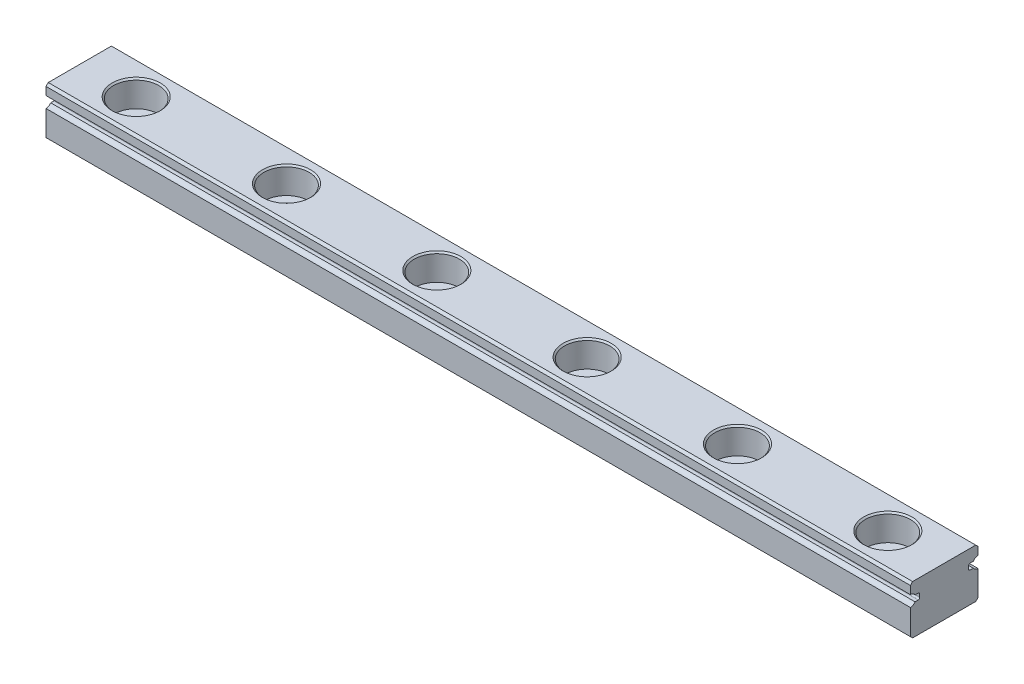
ISO-10303-21;
HEADER;
FILE_DESCRIPTION(('STEP AP214'),'2;1');
FILE_NAME('part.step','',(''),(''),'','','');
FILE_SCHEMA(('AUTOMOTIVE_DESIGN { 1 0 10303 214 1 1 1 1 }'));
ENDSEC;
DATA;
#1=APPLICATION_CONTEXT('core data for automotive mechanical design processes');
#2=APPLICATION_PROTOCOL_DEFINITION('international standard','automotive_design',2000,#1);
#3=PRODUCT_CONTEXT('',#1,'mechanical');
#4=PRODUCT('Part','Part','',(#3));
#5=PRODUCT_RELATED_PRODUCT_CATEGORY('part','',(#4));
#6=PRODUCT_DEFINITION_FORMATION('','',#4);
#7=PRODUCT_DEFINITION_CONTEXT('part definition',#1,'design');
#8=PRODUCT_DEFINITION('design','',#6,#7);
#9=PRODUCT_DEFINITION_SHAPE('','',#8);
#10=(LENGTH_UNIT() NAMED_UNIT(*) SI_UNIT(.MILLI.,.METRE.));
#11=(NAMED_UNIT(*) PLANE_ANGLE_UNIT() SI_UNIT($,.RADIAN.));
#12=(NAMED_UNIT(*) SI_UNIT($,.STERADIAN.) SOLID_ANGLE_UNIT());
#13=UNCERTAINTY_MEASURE_WITH_UNIT(LENGTH_MEASURE(1.E-05),#10,'distance_accuracy_value','');
#14=(GEOMETRIC_REPRESENTATION_CONTEXT(3) GLOBAL_UNCERTAINTY_ASSIGNED_CONTEXT((#13)) GLOBAL_UNIT_ASSIGNED_CONTEXT((#10,
#11,#12)) REPRESENTATION_CONTEXT('',''));
#15=CARTESIAN_POINT('',(0.,0.,0.));
#16=DIRECTION('',(0.,0.,1.));
#17=DIRECTION('',(1.,0.,0.));
#18=AXIS2_PLACEMENT_3D('',#15,#16,#17);
#19=CARTESIAN_POINT('',(115.,6.5,-4.2));
#20=DIRECTION('',(0.,-1.,0.));
#21=DIRECTION('',(0.,0.,-1.));
#22=AXIS2_PLACEMENT_3D('',#19,#20,#21);
#23=PLANE('',#22);
#24=DIRECTION('',(0.,0.,1.));
#25=VECTOR('',#24,1.);
#26=CARTESIAN_POINT('',(0.,6.5,-4.2));
#27=LINE('',#26,#25);
#28=CARTESIAN_POINT('',(0.,6.5,-4.2));
#29=VERTEX_POINT('',#28);
#30=CARTESIAN_POINT('',(0.,6.5,4.2));
#31=VERTEX_POINT('',#30);
#32=EDGE_CURVE('E11',#29,#31,#27,.T.);
#33=ORIENTED_EDGE('',*,*,#32,.T.);
#34=DIRECTION('',(-1.,0.,0.));
#35=VECTOR('',#34,1.);
#36=CARTESIAN_POINT('',(115.,6.5,4.2));
#37=LINE('',#36,#35);
#38=CARTESIAN_POINT('',(115.,6.5,4.2));
#39=VERTEX_POINT('',#38);
#40=EDGE_CURVE('E42',#39,#31,#37,.T.);
#41=ORIENTED_EDGE('',*,*,#40,.F.);
#42=DIRECTION('',(0.,0.,1.));
#43=VECTOR('',#42,1.);
#44=CARTESIAN_POINT('',(115.,6.5,-4.2));
#45=LINE('',#44,#43);
#46=CARTESIAN_POINT('',(115.,6.5,-4.2));
#47=VERTEX_POINT('',#46);
#48=EDGE_CURVE('E591',#47,#39,#45,.T.);
#49=ORIENTED_EDGE('',*,*,#48,.F.);
#50=DIRECTION('',(-1.,0.,0.));
#51=VECTOR('',#50,1.);
#52=CARTESIAN_POINT('',(115.,6.5,-4.2));
#53=LINE('',#52,#51);
#54=EDGE_CURVE('E28',#47,#29,#53,.T.);
#55=ORIENTED_EDGE('',*,*,#54,.T.);
#56=EDGE_LOOP('',(#33,#41,#49,#55));
#57=FACE_BOUND('',#56,.T.);
#58=CARTESIAN_POINT('',(7.5,6.5,0.));
#59=DIRECTION('',(0.,-1.,0.));
#60=DIRECTION('',(0.,0.,-1.));
#61=AXIS2_PLACEMENT_3D('',#58,#59,#60);
#62=CIRCLE('',#61,3.205);
#63=CARTESIAN_POINT('',(7.5,6.5,-3.205));
#64=VERTEX_POINT('',#63);
#65=EDGE_CURVE('E631',#64,#64,#62,.T.);
#66=ORIENTED_EDGE('',*,*,#65,.T.);
#67=EDGE_LOOP('',(#66));
#68=FACE_BOUND('',#67,.T.);
#69=CARTESIAN_POINT('',(47.5,6.5,0.));
#70=DIRECTION('',(0.,-1.,0.));
#71=DIRECTION('',(0.,0.,-1.));
#72=AXIS2_PLACEMENT_3D('',#69,#70,#71);
#73=CIRCLE('',#72,3.205);
#74=CARTESIAN_POINT('',(47.5,6.5,-3.205));
#75=VERTEX_POINT('',#74);
#76=EDGE_CURVE('E635',#75,#75,#73,.T.);
#77=ORIENTED_EDGE('',*,*,#76,.T.);
#78=EDGE_LOOP('',(#77));
#79=FACE_BOUND('',#78,.T.);
#80=CARTESIAN_POINT('',(67.5,6.5,0.));
#81=DIRECTION('',(0.,-1.,0.));
#82=DIRECTION('',(0.,0.,-1.));
#83=AXIS2_PLACEMENT_3D('',#80,#81,#82);
#84=CIRCLE('',#83,3.205);
#85=CARTESIAN_POINT('',(67.5,6.5,-3.205));
#86=VERTEX_POINT('',#85);
#87=EDGE_CURVE('E660',#86,#86,#84,.T.);
#88=ORIENTED_EDGE('',*,*,#87,.T.);
#89=EDGE_LOOP('',(#88));
#90=FACE_BOUND('',#89,.T.);
#91=CARTESIAN_POINT('',(87.5,6.5,0.));
#92=DIRECTION('',(0.,-1.,0.));
#93=DIRECTION('',(0.,0.,-1.));
#94=AXIS2_PLACEMENT_3D('',#91,#92,#93);
#95=CIRCLE('',#94,3.205);
#96=CARTESIAN_POINT('',(87.5,6.5,-3.205));
#97=VERTEX_POINT('',#96);
#98=EDGE_CURVE('E664',#97,#97,#95,.T.);
#99=ORIENTED_EDGE('',*,*,#98,.T.);
#100=EDGE_LOOP('',(#99));
#101=FACE_BOUND('',#100,.T.);
#102=CARTESIAN_POINT('',(107.5,6.5,0.));
#103=DIRECTION('',(0.,-1.,0.));
#104=DIRECTION('',(0.,0.,-1.));
#105=AXIS2_PLACEMENT_3D('',#102,#103,#104);
#106=CIRCLE('',#105,3.205);
#107=CARTESIAN_POINT('',(107.5,6.5,-3.205));
#108=VERTEX_POINT('',#107);
#109=EDGE_CURVE('E539',#108,#108,#106,.T.);
#110=ORIENTED_EDGE('',*,*,#109,.T.);
#111=EDGE_LOOP('',(#110));
#112=FACE_BOUND('',#111,.T.);
#113=CARTESIAN_POINT('',(27.5,6.5,0.));
#114=DIRECTION('',(0.,-1.,0.));
#115=DIRECTION('',(0.,0.,-1.));
#116=AXIS2_PLACEMENT_3D('',#113,#114,#115);
#117=CIRCLE('',#116,3.205);
#118=CARTESIAN_POINT('',(27.5,6.5,-3.205));
#119=VERTEX_POINT('',#118);
#120=EDGE_CURVE('E535',#119,#119,#117,.T.);
#121=ORIENTED_EDGE('',*,*,#120,.T.);
#122=EDGE_LOOP('',(#121));
#123=FACE_BOUND('',#122,.T.);
#124=ADVANCED_FACE('F17',(#57,#68,#79,#90,#101,#112,#123),#23,.F.);
#125=CARTESIAN_POINT('',(115.,4.4,4.5));
#126=DIRECTION('',(1.,0.,0.));
#127=DIRECTION('',(0.,1.,0.));
#128=AXIS2_PLACEMENT_3D('',#125,#126,#127);
#129=PLANE('',#128);
#130=DIRECTION('',(0.,-0.707106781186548,0.707106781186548));
#131=VECTOR('',#130,1.);
#132=CARTESIAN_POINT('',(115.,6.5,4.2));
#133=LINE('',#132,#131);
#134=CARTESIAN_POINT('',(115.,6.2,4.5));
#135=VERTEX_POINT('',#134);
#136=EDGE_CURVE('E374',#39,#135,#133,.T.);
#137=ORIENTED_EDGE('',*,*,#136,.T.);
#138=DIRECTION('',(0.,-1.,0.));
#139=VECTOR('',#138,1.);
#140=CARTESIAN_POINT('',(115.,6.2,4.5));
#141=LINE('',#140,#139);
#142=CARTESIAN_POINT('',(115.,5.14204110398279,4.5));
#143=VERTEX_POINT('',#142);
#144=EDGE_CURVE('E371',#135,#143,#141,.T.);
#145=ORIENTED_EDGE('',*,*,#144,.T.);
#146=CARTESIAN_POINT('',(115.,4.4,4.5));
#147=DIRECTION('',(1.,0.,0.));
#148=DIRECTION('',(0.,0.,-1.));
#149=AXIS2_PLACEMENT_3D('',#146,#147,#148);
#150=CIRCLE('',#149,0.742041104);
#151=CARTESIAN_POINT('',(115.,4.8,3.875));
#152=VERTEX_POINT('',#151);
#153=EDGE_CURVE('E356',#152,#143,#150,.T.);
#154=ORIENTED_EDGE('',*,*,#153,.F.);
#155=DIRECTION('',(0.,0.,-1.));
#156=VECTOR('',#155,1.);
#157=CARTESIAN_POINT('',(115.,4.8,3.875));
#158=LINE('',#157,#156);
#159=CARTESIAN_POINT('',(115.,4.8,3.45));
#160=VERTEX_POINT('',#159);
#161=EDGE_CURVE('E378',#152,#160,#158,.T.);
#162=ORIENTED_EDGE('',*,*,#161,.T.);
#163=CARTESIAN_POINT('',(115.,4.6,3.45));
#164=DIRECTION('',(1.,0.,0.));
#165=DIRECTION('',(0.,0.,-1.));
#166=AXIS2_PLACEMENT_3D('',#163,#164,#165);
#167=CIRCLE('',#166,0.2);
#168=CARTESIAN_POINT('',(115.,4.6,3.25));
#169=VERTEX_POINT('',#168);
#170=EDGE_CURVE('E601',#169,#160,#167,.T.);
#171=ORIENTED_EDGE('',*,*,#170,.F.);
#172=DIRECTION('',(0.,-1.,0.));
#173=VECTOR('',#172,1.);
#174=CARTESIAN_POINT('',(115.,4.6,3.25));
#175=LINE('',#174,#173);
#176=CARTESIAN_POINT('',(115.,4.2,3.25));
#177=VERTEX_POINT('',#176);
#178=EDGE_CURVE('E418',#169,#177,#175,.T.);
#179=ORIENTED_EDGE('',*,*,#178,.T.);
#180=CARTESIAN_POINT('',(115.,4.2,3.45));
#181=DIRECTION('',(1.,0.,0.));
#182=DIRECTION('',(0.,0.,-1.));
#183=AXIS2_PLACEMENT_3D('',#180,#181,#182);
#184=CIRCLE('',#183,0.2);
#185=CARTESIAN_POINT('',(115.,4.,3.45));
#186=VERTEX_POINT('',#185);
#187=EDGE_CURVE('E625',#186,#177,#184,.T.);
#188=ORIENTED_EDGE('',*,*,#187,.F.);
#189=DIRECTION('',(0.,0.,1.));
#190=VECTOR('',#189,1.);
#191=CARTESIAN_POINT('',(115.,4.,3.45));
#192=LINE('',#191,#190);
#193=CARTESIAN_POINT('',(115.,4.,3.875));
#194=VERTEX_POINT('',#193);
#195=EDGE_CURVE('E511',#186,#194,#192,.T.);
#196=ORIENTED_EDGE('',*,*,#195,.T.);
#197=CARTESIAN_POINT('',(115.,4.4,4.5));
#198=DIRECTION('',(1.,0.,0.));
#199=DIRECTION('',(0.,0.,-1.));
#200=AXIS2_PLACEMENT_3D('',#197,#198,#199);
#201=CIRCLE('',#200,0.742041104);
#202=CARTESIAN_POINT('',(115.,3.65795889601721,4.5));
#203=VERTEX_POINT('',#202);
#204=EDGE_CURVE('E497',#203,#194,#201,.T.);
#205=ORIENTED_EDGE('',*,*,#204,.F.);
#206=DIRECTION('',(0.,-1.,0.));
#207=VECTOR('',#206,1.);
#208=CARTESIAN_POINT('',(115.,3.65795889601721,4.5));
#209=LINE('',#208,#207);
#210=CARTESIAN_POINT('',(115.,0.3,4.5));
#211=VERTEX_POINT('',#210);
#212=EDGE_CURVE('E507',#203,#211,#209,.T.);
#213=ORIENTED_EDGE('',*,*,#212,.T.);
#214=DIRECTION('',(0.,-0.707106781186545,-0.70710678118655));
#215=VECTOR('',#214,1.);
#216=CARTESIAN_POINT('',(115.,0.3,4.5));
#217=LINE('',#216,#215);
#218=CARTESIAN_POINT('',(115.,0.,4.2));
#219=VERTEX_POINT('',#218);
#220=EDGE_CURVE('E467',#211,#219,#217,.T.);
#221=ORIENTED_EDGE('',*,*,#220,.T.);
#222=DIRECTION('',(0.,0.,-1.));
#223=VECTOR('',#222,1.);
#224=CARTESIAN_POINT('',(115.,0.,4.2));
#225=LINE('',#224,#223);
#226=CARTESIAN_POINT('',(115.,0.,-4.2));
#227=VERTEX_POINT('',#226);
#228=EDGE_CURVE('E463',#219,#227,#225,.T.);
#229=ORIENTED_EDGE('',*,*,#228,.T.);
#230=DIRECTION('',(0.,0.707106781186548,-0.707106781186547));
#231=VECTOR('',#230,1.);
#232=CARTESIAN_POINT('',(115.,0.,-4.2));
#233=LINE('',#232,#231);
#234=CARTESIAN_POINT('',(115.,0.3,-4.5));
#235=VERTEX_POINT('',#234);
#236=EDGE_CURVE('E468',#227,#235,#233,.T.);
#237=ORIENTED_EDGE('',*,*,#236,.T.);
#238=DIRECTION('',(0.,1.,0.));
#239=VECTOR('',#238,1.);
#240=CARTESIAN_POINT('',(115.,0.3,-4.5));
#241=LINE('',#240,#239);
#242=CARTESIAN_POINT('',(115.,3.65795889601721,-4.5));
#243=VERTEX_POINT('',#242);
#244=EDGE_CURVE('E489',#235,#243,#241,.T.);
#245=ORIENTED_EDGE('',*,*,#244,.T.);
#246=CARTESIAN_POINT('',(115.,4.4,-4.5));
#247=DIRECTION('',(1.,0.,0.));
#248=DIRECTION('',(0.,0.,-1.));
#249=AXIS2_PLACEMENT_3D('',#246,#247,#248);
#250=CIRCLE('',#249,0.742041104);
#251=CARTESIAN_POINT('',(115.,4.,-3.875));
#252=VERTEX_POINT('',#251);
#253=EDGE_CURVE('E424',#252,#243,#250,.T.);
#254=ORIENTED_EDGE('',*,*,#253,.F.);
#255=DIRECTION('',(0.,0.,1.));
#256=VECTOR('',#255,1.);
#257=CARTESIAN_POINT('',(115.,4.,-3.875));
#258=LINE('',#257,#256);
#259=CARTESIAN_POINT('',(115.,4.,-3.45));
#260=VERTEX_POINT('',#259);
#261=EDGE_CURVE('E399',#252,#260,#258,.T.);
#262=ORIENTED_EDGE('',*,*,#261,.T.);
#263=CARTESIAN_POINT('',(115.,4.2,-3.45));
#264=DIRECTION('',(1.,0.,0.));
#265=DIRECTION('',(0.,0.,-1.));
#266=AXIS2_PLACEMENT_3D('',#263,#264,#265);
#267=CIRCLE('',#266,0.2);
#268=CARTESIAN_POINT('',(115.,4.2,-3.25));
#269=VERTEX_POINT('',#268);
#270=EDGE_CURVE('E452',#269,#260,#267,.T.);
#271=ORIENTED_EDGE('',*,*,#270,.F.);
#272=DIRECTION('',(0.,1.,0.));
#273=VECTOR('',#272,1.);
#274=CARTESIAN_POINT('',(115.,4.2,-3.25));
#275=LINE('',#274,#273);
#276=CARTESIAN_POINT('',(115.,4.6,-3.25));
#277=VERTEX_POINT('',#276);
#278=EDGE_CURVE('E396',#269,#277,#275,.T.);
#279=ORIENTED_EDGE('',*,*,#278,.T.);
#280=CARTESIAN_POINT('',(115.,4.6,-3.45));
#281=DIRECTION('',(1.,0.,0.));
#282=DIRECTION('',(0.,0.,-1.));
#283=AXIS2_PLACEMENT_3D('',#280,#281,#282);
#284=CIRCLE('',#283,0.2);
#285=CARTESIAN_POINT('',(115.,4.8,-3.45));
#286=VERTEX_POINT('',#285);
#287=EDGE_CURVE('E409',#286,#277,#284,.T.);
#288=ORIENTED_EDGE('',*,*,#287,.F.);
#289=DIRECTION('',(0.,0.,-1.));
#290=VECTOR('',#289,1.);
#291=CARTESIAN_POINT('',(115.,4.8,-3.45));
#292=LINE('',#291,#290);
#293=CARTESIAN_POINT('',(115.,4.8,-3.875));
#294=VERTEX_POINT('',#293);
#295=EDGE_CURVE('E400',#286,#294,#292,.T.);
#296=ORIENTED_EDGE('',*,*,#295,.T.);
#297=CARTESIAN_POINT('',(115.,4.4,-4.5));
#298=DIRECTION('',(1.,0.,0.));
#299=DIRECTION('',(0.,0.,-1.));
#300=AXIS2_PLACEMENT_3D('',#297,#298,#299);
#301=CIRCLE('',#300,0.742041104);
#302=CARTESIAN_POINT('',(115.,5.14204110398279,-4.5));
#303=VERTEX_POINT('',#302);
#304=EDGE_CURVE('E446',#303,#294,#301,.T.);
#305=ORIENTED_EDGE('',*,*,#304,.F.);
#306=DIRECTION('',(0.,1.,0.));
#307=VECTOR('',#306,1.);
#308=CARTESIAN_POINT('',(115.,5.14204110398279,-4.5));
#309=LINE('',#308,#307);
#310=CARTESIAN_POINT('',(115.,6.2,-4.5));
#311=VERTEX_POINT('',#310);
#312=EDGE_CURVE('E401',#303,#311,#309,.T.);
#313=ORIENTED_EDGE('',*,*,#312,.T.);
#314=DIRECTION('',(0.,0.707106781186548,0.707106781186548));
#315=VECTOR('',#314,1.);
#316=CARTESIAN_POINT('',(115.,6.2,-4.5));
#317=LINE('',#316,#315);
#318=EDGE_CURVE('E405',#311,#47,#317,.T.);
#319=ORIENTED_EDGE('',*,*,#318,.T.);
#320=ORIENTED_EDGE('',*,*,#48,.T.);
#321=EDGE_LOOP('',(#137,#145,#154,#162,#171,#179,#188,#196,#205,#213,#221,#229,#237,#245,#254,
#262,#271,#279,#288,#296,#305,#313,#319,#320));
#322=FACE_BOUND('',#321,.T.);
#323=ADVANCED_FACE('F372',(#322),#129,.T.);
#324=CARTESIAN_POINT('',(115.,6.2,-4.5));
#325=DIRECTION('',(0.,-0.707106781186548,0.707106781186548));
#326=DIRECTION('',(-1.,0.,0.));
#327=AXIS2_PLACEMENT_3D('',#324,#325,#326);
#328=PLANE('',#327);
#329=DIRECTION('',(0.,0.707106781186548,0.707106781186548));
#330=VECTOR('',#329,1.);
#331=CARTESIAN_POINT('',(0.,6.2,-4.5));
#332=LINE('',#331,#330);
#333=CARTESIAN_POINT('',(0.,6.2,-4.5));
#334=VERTEX_POINT('',#333);
#335=EDGE_CURVE('E587',#334,#29,#332,.T.);
#336=ORIENTED_EDGE('',*,*,#335,.T.);
#337=ORIENTED_EDGE('',*,*,#54,.F.);
#338=ORIENTED_EDGE('',*,*,#318,.F.);
#339=DIRECTION('',(-1.,0.,0.));
#340=VECTOR('',#339,1.);
#341=CARTESIAN_POINT('',(115.,6.2,-4.5));
#342=LINE('',#341,#340);
#343=EDGE_CURVE('E592',#311,#334,#342,.T.);
#344=ORIENTED_EDGE('',*,*,#343,.T.);
#345=EDGE_LOOP('',(#336,#337,#338,#344));
#346=FACE_BOUND('',#345,.T.);
#347=ADVANCED_FACE('F869',(#346),#328,.F.);
#348=CARTESIAN_POINT('',(115.,6.5,4.2));
#349=DIRECTION('',(0.,-0.707106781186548,-0.707106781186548));
#350=DIRECTION('',(0.,-0.707106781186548,0.707106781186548));
#351=AXIS2_PLACEMENT_3D('',#348,#349,#350);
#352=PLANE('',#351);
#353=DIRECTION('',(0.,-0.707106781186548,0.707106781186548));
#354=VECTOR('',#353,1.);
#355=CARTESIAN_POINT('',(0.,6.5,4.2));
#356=LINE('',#355,#354);
#357=CARTESIAN_POINT('',(0.,6.2,4.5));
#358=VERTEX_POINT('',#357);
#359=EDGE_CURVE('E614',#31,#358,#356,.T.);
#360=ORIENTED_EDGE('',*,*,#359,.T.);
#361=DIRECTION('',(-1.,0.,0.));
#362=VECTOR('',#361,1.);
#363=CARTESIAN_POINT('',(115.,6.2,4.5));
#364=LINE('',#363,#362);
#365=EDGE_CURVE('E368',#135,#358,#364,.T.);
#366=ORIENTED_EDGE('',*,*,#365,.F.);
#367=ORIENTED_EDGE('',*,*,#136,.F.);
#368=ORIENTED_EDGE('',*,*,#40,.T.);
#369=EDGE_LOOP('',(#360,#366,#367,#368));
#370=FACE_BOUND('',#369,.T.);
#371=ADVANCED_FACE('F1011',(#370),#352,.F.);
#372=CARTESIAN_POINT('',(115.,6.2,4.5));
#373=DIRECTION('',(0.,0.,-1.));
#374=DIRECTION('',(0.,-1.,0.));
#375=AXIS2_PLACEMENT_3D('',#372,#373,#374);
#376=PLANE('',#375);
#377=DIRECTION('',(0.,-1.,0.));
#378=VECTOR('',#377,1.);
#379=CARTESIAN_POINT('',(0.,6.2,4.5));
#380=LINE('',#379,#378);
#381=CARTESIAN_POINT('',(0.,5.14204110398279,4.5));
#382=VERTEX_POINT('',#381);
#383=EDGE_CURVE('E382',#358,#382,#380,.T.);
#384=ORIENTED_EDGE('',*,*,#383,.T.);
#385=DIRECTION('',(-1.,0.,0.));
#386=VECTOR('',#385,1.);
#387=CARTESIAN_POINT('',(115.,5.14204110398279,4.5));
#388=LINE('',#387,#386);
#389=EDGE_CURVE('E360',#143,#382,#388,.T.);
#390=ORIENTED_EDGE('',*,*,#389,.F.);
#391=ORIENTED_EDGE('',*,*,#144,.F.);
#392=ORIENTED_EDGE('',*,*,#365,.T.);
#393=EDGE_LOOP('',(#384,#390,#391,#392));
#394=FACE_BOUND('',#393,.T.);
#395=ADVANCED_FACE('F380',(#394),#376,.F.);
#396=CARTESIAN_POINT('',(115.,4.4,4.5));
#397=DIRECTION('',(1.,0.,0.));
#398=DIRECTION('',(0.,0.,1.));
#399=AXIS2_PLACEMENT_3D('',#396,#397,#398);
#400=CYLINDRICAL_SURFACE('',#399,0.742041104);
#401=CARTESIAN_POINT('',(0.,4.4,4.5));
#402=DIRECTION('',(1.,0.,0.));
#403=DIRECTION('',(0.,0.,-1.));
#404=AXIS2_PLACEMENT_3D('',#401,#402,#403);
#405=CIRCLE('',#404,0.742041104);
#406=CARTESIAN_POINT('',(0.,4.8,3.875));
#407=VERTEX_POINT('',#406);
#408=EDGE_CURVE('E462',#407,#382,#405,.T.);
#409=ORIENTED_EDGE('',*,*,#408,.F.);
#410=DIRECTION('',(-1.,0.,0.));
#411=VECTOR('',#410,1.);
#412=CARTESIAN_POINT('',(115.,4.8,3.875));
#413=LINE('',#412,#411);
#414=EDGE_CURVE('E363',#152,#407,#413,.T.);
#415=ORIENTED_EDGE('',*,*,#414,.F.);
#416=ORIENTED_EDGE('',*,*,#153,.T.);
#417=ORIENTED_EDGE('',*,*,#389,.T.);
#418=EDGE_LOOP('',(#409,#415,#416,#417));
#419=FACE_BOUND('',#418,.T.);
#420=ADVANCED_FACE('F358',(#419),#400,.F.);
#421=CARTESIAN_POINT('',(115.,4.8,3.875));
#422=DIRECTION('',(0.,1.,0.));
#423=DIRECTION('',(1.,0.,0.));
#424=AXIS2_PLACEMENT_3D('',#421,#422,#423);
#425=PLANE('',#424);
#426=DIRECTION('',(0.,0.,-1.));
#427=VECTOR('',#426,1.);
#428=CARTESIAN_POINT('',(0.,4.8,3.875));
#429=LINE('',#428,#427);
#430=CARTESIAN_POINT('',(0.,4.8,3.45));
#431=VERTEX_POINT('',#430);
#432=EDGE_CURVE('E385',#407,#431,#429,.T.);
#433=ORIENTED_EDGE('',*,*,#432,.T.);
#434=DIRECTION('',(-1.,0.,0.));
#435=VECTOR('',#434,1.);
#436=CARTESIAN_POINT('',(115.,4.8,3.45));
#437=LINE('',#436,#435);
#438=EDGE_CURVE('E435',#160,#431,#437,.T.);
#439=ORIENTED_EDGE('',*,*,#438,.F.);
#440=ORIENTED_EDGE('',*,*,#161,.F.);
#441=ORIENTED_EDGE('',*,*,#414,.T.);
#442=EDGE_LOOP('',(#433,#439,#440,#441));
#443=FACE_BOUND('',#442,.T.);
#444=ADVANCED_FACE('F992',(#443),#425,.F.);
#445=CARTESIAN_POINT('',(115.,4.6,3.45));
#446=DIRECTION('',(1.,0.,0.));
#447=DIRECTION('',(0.,0.,1.));
#448=AXIS2_PLACEMENT_3D('',#445,#446,#447);
#449=CYLINDRICAL_SURFACE('',#448,0.2);
#450=CARTESIAN_POINT('',(0.,4.6,3.45));
#451=DIRECTION('',(1.,0.,0.));
#452=DIRECTION('',(0.,0.,-1.));
#453=AXIS2_PLACEMENT_3D('',#450,#451,#452);
#454=CIRCLE('',#453,0.2);
#455=CARTESIAN_POINT('',(0.,4.6,3.25));
#456=VERTEX_POINT('',#455);
#457=EDGE_CURVE('E458',#456,#431,#454,.T.);
#458=ORIENTED_EDGE('',*,*,#457,.F.);
#459=DIRECTION('',(-1.,0.,0.));
#460=VECTOR('',#459,1.);
#461=CARTESIAN_POINT('',(115.,4.6,3.25));
#462=LINE('',#461,#460);
#463=EDGE_CURVE('E436',#169,#456,#462,.T.);
#464=ORIENTED_EDGE('',*,*,#463,.F.);
#465=ORIENTED_EDGE('',*,*,#170,.T.);
#466=ORIENTED_EDGE('',*,*,#438,.T.);
#467=EDGE_LOOP('',(#458,#464,#465,#466));
#468=FACE_BOUND('',#467,.T.);
#469=ADVANCED_FACE('F995',(#468),#449,.F.);
#470=CARTESIAN_POINT('',(115.,4.6,3.25));
#471=DIRECTION('',(0.,0.,-1.));
#472=DIRECTION('',(0.,-1.,0.));
#473=AXIS2_PLACEMENT_3D('',#470,#471,#472);
#474=PLANE('',#473);
#475=DIRECTION('',(0.,-1.,0.));
#476=VECTOR('',#475,1.);
#477=CARTESIAN_POINT('',(0.,4.6,3.25));
#478=LINE('',#477,#476);
#479=CARTESIAN_POINT('',(0.,4.2,3.25));
#480=VERTEX_POINT('',#479);
#481=EDGE_CURVE('E431',#456,#480,#478,.T.);
#482=ORIENTED_EDGE('',*,*,#481,.T.);
#483=DIRECTION('',(-1.,0.,0.));
#484=VECTOR('',#483,1.);
#485=CARTESIAN_POINT('',(115.,4.2,3.25));
#486=LINE('',#485,#484);
#487=EDGE_CURVE('E456',#177,#480,#486,.T.);
#488=ORIENTED_EDGE('',*,*,#487,.F.);
#489=ORIENTED_EDGE('',*,*,#178,.F.);
#490=ORIENTED_EDGE('',*,*,#463,.T.);
#491=EDGE_LOOP('',(#482,#488,#489,#490));
#492=FACE_BOUND('',#491,.T.);
#493=ADVANCED_FACE('F763',(#492),#474,.F.);
#494=CARTESIAN_POINT('',(115.,4.2,3.45));
#495=DIRECTION('',(1.,0.,0.));
#496=DIRECTION('',(0.,0.,1.));
#497=AXIS2_PLACEMENT_3D('',#494,#495,#496);
#498=CYLINDRICAL_SURFACE('',#497,0.2);
#499=CARTESIAN_POINT('',(0.,4.2,3.45));
#500=DIRECTION('',(1.,0.,0.));
#501=DIRECTION('',(0.,0.,-1.));
#502=AXIS2_PLACEMENT_3D('',#499,#500,#501);
#503=CIRCLE('',#502,0.2);
#504=CARTESIAN_POINT('',(0.,4.,3.45));
#505=VERTEX_POINT('',#504);
#506=EDGE_CURVE('E293',#505,#480,#503,.T.);
#507=ORIENTED_EDGE('',*,*,#506,.F.);
#508=DIRECTION('',(-1.,0.,0.));
#509=VECTOR('',#508,1.);
#510=CARTESIAN_POINT('',(115.,4.,3.45));
#511=LINE('',#510,#509);
#512=EDGE_CURVE('E457',#186,#505,#511,.T.);
#513=ORIENTED_EDGE('',*,*,#512,.F.);
#514=ORIENTED_EDGE('',*,*,#187,.T.);
#515=ORIENTED_EDGE('',*,*,#487,.T.);
#516=EDGE_LOOP('',(#507,#513,#514,#515));
#517=FACE_BOUND('',#516,.T.);
#518=ADVANCED_FACE('F755',(#517),#498,.F.);
#519=CARTESIAN_POINT('',(115.,4.,3.45));
#520=DIRECTION('',(0.,-1.,0.));
#521=DIRECTION('',(0.,0.,-1.));
#522=AXIS2_PLACEMENT_3D('',#519,#520,#521);
#523=PLANE('',#522);
#524=DIRECTION('',(0.,0.,1.));
#525=VECTOR('',#524,1.);
#526=CARTESIAN_POINT('',(0.,4.,3.45));
#527=LINE('',#526,#525);
#528=CARTESIAN_POINT('',(0.,4.,3.875));
#529=VERTEX_POINT('',#528);
#530=EDGE_CURVE('E453',#505,#529,#527,.T.);
#531=ORIENTED_EDGE('',*,*,#530,.T.);
#532=DIRECTION('',(-1.,0.,0.));
#533=VECTOR('',#532,1.);
#534=CARTESIAN_POINT('',(115.,4.,3.875));
#535=LINE('',#534,#533);
#536=EDGE_CURVE('E282',#194,#529,#535,.T.);
#537=ORIENTED_EDGE('',*,*,#536,.F.);
#538=ORIENTED_EDGE('',*,*,#195,.F.);
#539=ORIENTED_EDGE('',*,*,#512,.T.);
#540=EDGE_LOOP('',(#531,#537,#538,#539));
#541=FACE_BOUND('',#540,.T.);
#542=ADVANCED_FACE('F754',(#541),#523,.F.);
#543=CARTESIAN_POINT('',(115.,4.4,4.5));
#544=DIRECTION('',(1.,0.,0.));
#545=DIRECTION('',(0.,0.,1.));
#546=AXIS2_PLACEMENT_3D('',#543,#544,#545);
#547=CYLINDRICAL_SURFACE('',#546,0.742041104);
#548=CARTESIAN_POINT('',(0.,4.4,4.5));
#549=DIRECTION('',(1.,0.,0.));
#550=DIRECTION('',(0.,0.,-1.));
#551=AXIS2_PLACEMENT_3D('',#548,#549,#550);
#552=CIRCLE('',#551,0.742041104);
#553=CARTESIAN_POINT('',(0.,3.65795889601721,4.5));
#554=VERTEX_POINT('',#553);
#555=EDGE_CURVE('E586',#554,#529,#552,.T.);
#556=ORIENTED_EDGE('',*,*,#555,.F.);
#557=DIRECTION('',(-1.,0.,0.));
#558=VECTOR('',#557,1.);
#559=CARTESIAN_POINT('',(115.,3.65795889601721,4.5));
#560=LINE('',#559,#558);
#561=EDGE_CURVE('E606',#203,#554,#560,.T.);
#562=ORIENTED_EDGE('',*,*,#561,.F.);
#563=ORIENTED_EDGE('',*,*,#204,.T.);
#564=ORIENTED_EDGE('',*,*,#536,.T.);
#565=EDGE_LOOP('',(#556,#562,#563,#564));
#566=FACE_BOUND('',#565,.T.);
#567=ADVANCED_FACE('F746',(#566),#547,.F.);
#568=CARTESIAN_POINT('',(115.,3.65795889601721,4.5));
#569=DIRECTION('',(0.,0.,-1.));
#570=DIRECTION('',(0.,-1.,0.));
#571=AXIS2_PLACEMENT_3D('',#568,#569,#570);
#572=PLANE('',#571);
#573=DIRECTION('',(0.,-1.,0.));
#574=VECTOR('',#573,1.);
#575=CARTESIAN_POINT('',(0.,3.65795889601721,4.5));
#576=LINE('',#575,#574);
#577=CARTESIAN_POINT('',(0.,0.3,4.5));
#578=VERTEX_POINT('',#577);
#579=EDGE_CURVE('E610',#554,#578,#576,.T.);
#580=ORIENTED_EDGE('',*,*,#579,.T.);
#581=DIRECTION('',(-1.,0.,0.));
#582=VECTOR('',#581,1.);
#583=CARTESIAN_POINT('',(115.,0.3,4.5));
#584=LINE('',#583,#582);
#585=EDGE_CURVE('E605',#211,#578,#584,.T.);
#586=ORIENTED_EDGE('',*,*,#585,.F.);
#587=ORIENTED_EDGE('',*,*,#212,.F.);
#588=ORIENTED_EDGE('',*,*,#561,.T.);
#589=EDGE_LOOP('',(#580,#586,#587,#588));
#590=FACE_BOUND('',#589,.T.);
#591=ADVANCED_FACE('F749',(#590),#572,.F.);
#592=CARTESIAN_POINT('',(115.,0.3,4.5));
#593=DIRECTION('',(0.,0.70710678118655,-0.707106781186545));
#594=DIRECTION('',(-1.,0.,0.));
#595=AXIS2_PLACEMENT_3D('',#592,#593,#594);
#596=PLANE('',#595);
#597=DIRECTION('',(0.,-0.707106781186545,-0.70710678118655));
#598=VECTOR('',#597,1.);
#599=CARTESIAN_POINT('',(0.,0.3,4.5));
#600=LINE('',#599,#598);
#601=CARTESIAN_POINT('',(0.,0.,4.2));
#602=VERTEX_POINT('',#601);
#603=EDGE_CURVE('E611',#578,#602,#600,.T.);
#604=ORIENTED_EDGE('',*,*,#603,.T.);
#605=DIRECTION('',(-1.,0.,0.));
#606=VECTOR('',#605,1.);
#607=CARTESIAN_POINT('',(115.,0.,4.2));
#608=LINE('',#607,#606);
#609=EDGE_CURVE('E425',#219,#602,#608,.T.);
#610=ORIENTED_EDGE('',*,*,#609,.F.);
#611=ORIENTED_EDGE('',*,*,#220,.F.);
#612=ORIENTED_EDGE('',*,*,#585,.T.);
#613=EDGE_LOOP('',(#604,#610,#611,#612));
#614=FACE_BOUND('',#613,.T.);
#615=ADVANCED_FACE('F901',(#614),#596,.F.);
#616=CARTESIAN_POINT('',(115.,0.,4.2));
#617=DIRECTION('',(0.,1.,0.));
#618=DIRECTION('',(1.,0.,0.));
#619=AXIS2_PLACEMENT_3D('',#616,#617,#618);
#620=PLANE('',#619);
#621=DIRECTION('',(0.,0.,-1.));
#622=VECTOR('',#621,1.);
#623=CARTESIAN_POINT('',(0.,0.,4.2));
#624=LINE('',#623,#622);
#625=CARTESIAN_POINT('',(0.,0.,-4.2));
#626=VERTEX_POINT('',#625);
#627=EDGE_CURVE('E429',#602,#626,#624,.T.);
#628=ORIENTED_EDGE('',*,*,#627,.T.);
#629=DIRECTION('',(-1.,0.,0.));
#630=VECTOR('',#629,1.);
#631=CARTESIAN_POINT('',(115.,0.,-4.2));
#632=LINE('',#631,#630);
#633=EDGE_CURVE('E665',#227,#626,#632,.T.);
#634=ORIENTED_EDGE('',*,*,#633,.F.);
#635=ORIENTED_EDGE('',*,*,#228,.F.);
#636=ORIENTED_EDGE('',*,*,#609,.T.);
#637=EDGE_LOOP('',(#628,#634,#635,#636));
#638=FACE_BOUND('',#637,.T.);
#639=CARTESIAN_POINT('',(7.5,0.,0.));
#640=DIRECTION('',(0.,-1.,0.));
#641=DIRECTION('',(0.,0.,-1.));
#642=AXIS2_PLACEMENT_3D('',#639,#640,#641);
#643=CIRCLE('',#642,1.955);
#644=CARTESIAN_POINT('',(7.5,0.,-1.955));
#645=VERTEX_POINT('',#644);
#646=EDGE_CURVE('E490',#645,#645,#643,.T.);
#647=ORIENTED_EDGE('',*,*,#646,.F.);
#648=EDGE_LOOP('',(#647));
#649=FACE_BOUND('',#648,.T.);
#650=CARTESIAN_POINT('',(47.5,0.,0.));
#651=DIRECTION('',(0.,-1.,0.));
#652=DIRECTION('',(0.,0.,-1.));
#653=AXIS2_PLACEMENT_3D('',#650,#651,#652);
#654=CIRCLE('',#653,1.955);
#655=CARTESIAN_POINT('',(47.5,0.,-1.955));
#656=VERTEX_POINT('',#655);
#657=EDGE_CURVE('E557',#656,#656,#654,.T.);
#658=ORIENTED_EDGE('',*,*,#657,.F.);
#659=EDGE_LOOP('',(#658));
#660=FACE_BOUND('',#659,.T.);
#661=CARTESIAN_POINT('',(67.5,0.,0.));
#662=DIRECTION('',(0.,-1.,0.));
#663=DIRECTION('',(0.,0.,-1.));
#664=AXIS2_PLACEMENT_3D('',#661,#662,#663);
#665=CIRCLE('',#664,1.955);
#666=CARTESIAN_POINT('',(67.5,0.,-1.955));
#667=VERTEX_POINT('',#666);
#668=EDGE_CURVE('E529',#667,#667,#665,.T.);
#669=ORIENTED_EDGE('',*,*,#668,.F.);
#670=EDGE_LOOP('',(#669));
#671=FACE_BOUND('',#670,.T.);
#672=CARTESIAN_POINT('',(87.5,0.,0.));
#673=DIRECTION('',(0.,-1.,0.));
#674=DIRECTION('',(0.,0.,-1.));
#675=AXIS2_PLACEMENT_3D('',#672,#673,#674);
#676=CIRCLE('',#675,1.955);
#677=CARTESIAN_POINT('',(87.5,0.,-1.955));
#678=VERTEX_POINT('',#677);
#679=EDGE_CURVE('E555',#678,#678,#676,.T.);
#680=ORIENTED_EDGE('',*,*,#679,.F.);
#681=EDGE_LOOP('',(#680));
#682=FACE_BOUND('',#681,.T.);
#683=CARTESIAN_POINT('',(107.5,0.,0.));
#684=DIRECTION('',(0.,-1.,0.));
#685=DIRECTION('',(0.,0.,-1.));
#686=AXIS2_PLACEMENT_3D('',#683,#684,#685);
#687=CIRCLE('',#686,1.955);
#688=CARTESIAN_POINT('',(107.5,0.,-1.955));
#689=VERTEX_POINT('',#688);
#690=EDGE_CURVE('E521',#689,#689,#687,.T.);
#691=ORIENTED_EDGE('',*,*,#690,.F.);
#692=EDGE_LOOP('',(#691));
#693=FACE_BOUND('',#692,.T.);
#694=CARTESIAN_POINT('',(27.5,0.,0.));
#695=DIRECTION('',(0.,-1.,0.));
#696=DIRECTION('',(0.,0.,-1.));
#697=AXIS2_PLACEMENT_3D('',#694,#695,#696);
#698=CIRCLE('',#697,1.955);
#699=CARTESIAN_POINT('',(27.5,0.,-1.955));
#700=VERTEX_POINT('',#699);
#701=EDGE_CURVE('E542',#700,#700,#698,.T.);
#702=ORIENTED_EDGE('',*,*,#701,.F.);
#703=EDGE_LOOP('',(#702));
#704=FACE_BOUND('',#703,.T.);
#705=ADVANCED_FACE('F904',(#638,#649,#660,#671,#682,#693,#704),#620,.F.);
#706=CARTESIAN_POINT('',(115.,0.,-4.2));
#707=DIRECTION('',(0.,0.707106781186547,0.707106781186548));
#708=DIRECTION('',(1.,0.,0.));
#709=AXIS2_PLACEMENT_3D('',#706,#707,#708);
#710=PLANE('',#709);
#711=DIRECTION('',(0.,0.707106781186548,-0.707106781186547));
#712=VECTOR('',#711,1.);
#713=CARTESIAN_POINT('',(0.,0.,-4.2));
#714=LINE('',#713,#712);
#715=CARTESIAN_POINT('',(0.,0.3,-4.5));
#716=VERTEX_POINT('',#715);
#717=EDGE_CURVE('E430',#626,#716,#714,.T.);
#718=ORIENTED_EDGE('',*,*,#717,.T.);
#719=DIRECTION('',(-1.,0.,0.));
#720=VECTOR('',#719,1.);
#721=CARTESIAN_POINT('',(115.,0.3,-4.5));
#722=LINE('',#721,#720);
#723=EDGE_CURVE('E419',#235,#716,#722,.T.);
#724=ORIENTED_EDGE('',*,*,#723,.F.);
#725=ORIENTED_EDGE('',*,*,#236,.F.);
#726=ORIENTED_EDGE('',*,*,#633,.T.);
#727=EDGE_LOOP('',(#718,#724,#725,#726));
#728=FACE_BOUND('',#727,.T.);
#729=ADVANCED_FACE('F906',(#728),#710,.F.);
#730=CARTESIAN_POINT('',(115.,0.3,-4.5));
#731=DIRECTION('',(0.,0.,1.));
#732=DIRECTION('',(1.,0.,0.));
#733=AXIS2_PLACEMENT_3D('',#730,#731,#732);
#734=PLANE('',#733);
#735=DIRECTION('',(0.,1.,0.));
#736=VECTOR('',#735,1.);
#737=CARTESIAN_POINT('',(0.,0.3,-4.5));
#738=LINE('',#737,#736);
#739=CARTESIAN_POINT('',(0.,3.65795889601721,-4.5));
#740=VERTEX_POINT('',#739);
#741=EDGE_CURVE('E423',#716,#740,#738,.T.);
#742=ORIENTED_EDGE('',*,*,#741,.T.);
#743=DIRECTION('',(-1.,0.,0.));
#744=VECTOR('',#743,1.);
#745=CARTESIAN_POINT('',(115.,3.65795889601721,-4.5));
#746=LINE('',#745,#744);
#747=EDGE_CURVE('E476',#243,#740,#746,.T.);
#748=ORIENTED_EDGE('',*,*,#747,.F.);
#749=ORIENTED_EDGE('',*,*,#244,.F.);
#750=ORIENTED_EDGE('',*,*,#723,.T.);
#751=EDGE_LOOP('',(#742,#748,#749,#750));
#752=FACE_BOUND('',#751,.T.);
#753=ADVANCED_FACE('F814',(#752),#734,.F.);
#754=CARTESIAN_POINT('',(115.,4.4,-4.5));
#755=DIRECTION('',(1.,0.,0.));
#756=DIRECTION('',(0.,0.,1.));
#757=AXIS2_PLACEMENT_3D('',#754,#755,#756);
#758=CYLINDRICAL_SURFACE('',#757,0.742041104);
#759=CARTESIAN_POINT('',(0.,4.4,-4.5));
#760=DIRECTION('',(1.,0.,0.));
#761=DIRECTION('',(0.,0.,-1.));
#762=AXIS2_PLACEMENT_3D('',#759,#760,#761);
#763=CIRCLE('',#762,0.742041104);
#764=CARTESIAN_POINT('',(0.,4.,-3.875));
#765=VERTEX_POINT('',#764);
#766=EDGE_CURVE('E503',#765,#740,#763,.T.);
#767=ORIENTED_EDGE('',*,*,#766,.F.);
#768=DIRECTION('',(-1.,0.,0.));
#769=VECTOR('',#768,1.);
#770=CARTESIAN_POINT('',(115.,4.,-3.875));
#771=LINE('',#770,#769);
#772=EDGE_CURVE('E447',#252,#765,#771,.T.);
#773=ORIENTED_EDGE('',*,*,#772,.F.);
#774=ORIENTED_EDGE('',*,*,#253,.T.);
#775=ORIENTED_EDGE('',*,*,#747,.T.);
#776=EDGE_LOOP('',(#767,#773,#774,#775));
#777=FACE_BOUND('',#776,.T.);
#778=ADVANCED_FACE('F811',(#777),#758,.F.);
#779=CARTESIAN_POINT('',(115.,4.,-3.875));
#780=DIRECTION('',(0.,-1.,0.));
#781=DIRECTION('',(0.,0.,-1.));
#782=AXIS2_PLACEMENT_3D('',#779,#780,#781);
#783=PLANE('',#782);
#784=DIRECTION('',(0.,0.,1.));
#785=VECTOR('',#784,1.);
#786=CARTESIAN_POINT('',(0.,4.,-3.875));
#787=LINE('',#786,#785);
#788=CARTESIAN_POINT('',(0.,4.,-3.45));
#789=VERTEX_POINT('',#788);
#790=EDGE_CURVE('E451',#765,#789,#787,.T.);
#791=ORIENTED_EDGE('',*,*,#790,.T.);
#792=DIRECTION('',(-1.,0.,0.));
#793=VECTOR('',#792,1.);
#794=CARTESIAN_POINT('',(115.,4.,-3.45));
#795=LINE('',#794,#793);
#796=EDGE_CURVE('E479',#260,#789,#795,.T.);
#797=ORIENTED_EDGE('',*,*,#796,.F.);
#798=ORIENTED_EDGE('',*,*,#261,.F.);
#799=ORIENTED_EDGE('',*,*,#772,.T.);
#800=EDGE_LOOP('',(#791,#797,#798,#799));
#801=FACE_BOUND('',#800,.T.);
#802=ADVANCED_FACE('F807',(#801),#783,.F.);
#803=CARTESIAN_POINT('',(115.,4.2,-3.45));
#804=DIRECTION('',(1.,0.,0.));
#805=DIRECTION('',(0.,0.,1.));
#806=AXIS2_PLACEMENT_3D('',#803,#804,#805);
#807=CYLINDRICAL_SURFACE('',#806,0.2);
#808=CARTESIAN_POINT('',(0.,4.2,-3.45));
#809=DIRECTION('',(1.,0.,0.));
#810=DIRECTION('',(0.,0.,-1.));
#811=AXIS2_PLACEMENT_3D('',#808,#809,#810);
#812=CIRCLE('',#811,0.2);
#813=CARTESIAN_POINT('',(0.,4.2,-3.25));
#814=VERTEX_POINT('',#813);
#815=EDGE_CURVE('E498',#814,#789,#812,.T.);
#816=ORIENTED_EDGE('',*,*,#815,.F.);
#817=DIRECTION('',(-1.,0.,0.));
#818=VECTOR('',#817,1.);
#819=CARTESIAN_POINT('',(115.,4.2,-3.25));
#820=LINE('',#819,#818);
#821=EDGE_CURVE('E437',#269,#814,#820,.T.);
#822=ORIENTED_EDGE('',*,*,#821,.F.);
#823=ORIENTED_EDGE('',*,*,#270,.T.);
#824=ORIENTED_EDGE('',*,*,#796,.T.);
#825=EDGE_LOOP('',(#816,#822,#823,#824));
#826=FACE_BOUND('',#825,.T.);
#827=ADVANCED_FACE('F800',(#826),#807,.F.);
#828=CARTESIAN_POINT('',(115.,4.2,-3.25));
#829=DIRECTION('',(0.,0.,1.));
#830=DIRECTION('',(1.,0.,0.));
#831=AXIS2_PLACEMENT_3D('',#828,#829,#830);
#832=PLANE('',#831);
#833=DIRECTION('',(0.,1.,0.));
#834=VECTOR('',#833,1.);
#835=CARTESIAN_POINT('',(0.,4.2,-3.25));
#836=LINE('',#835,#834);
#837=CARTESIAN_POINT('',(0.,4.6,-3.25));
#838=VERTEX_POINT('',#837);
#839=EDGE_CURVE('E441',#814,#838,#836,.T.);
#840=ORIENTED_EDGE('',*,*,#839,.T.);
#841=DIRECTION('',(-1.,0.,0.));
#842=VECTOR('',#841,1.);
#843=CARTESIAN_POINT('',(115.,4.6,-3.25));
#844=LINE('',#843,#842);
#845=EDGE_CURVE('E406',#277,#838,#844,.T.);
#846=ORIENTED_EDGE('',*,*,#845,.F.);
#847=ORIENTED_EDGE('',*,*,#278,.F.);
#848=ORIENTED_EDGE('',*,*,#821,.T.);
#849=EDGE_LOOP('',(#840,#846,#847,#848));
#850=FACE_BOUND('',#849,.T.);
#851=ADVANCED_FACE('F780',(#850),#832,.F.);
#852=CARTESIAN_POINT('',(115.,4.6,-3.45));
#853=DIRECTION('',(1.,0.,0.));
#854=DIRECTION('',(0.,0.,1.));
#855=AXIS2_PLACEMENT_3D('',#852,#853,#854);
#856=CYLINDRICAL_SURFACE('',#855,0.2);
#857=CARTESIAN_POINT('',(0.,4.6,-3.45));
#858=DIRECTION('',(1.,0.,0.));
#859=DIRECTION('',(0.,0.,-1.));
#860=AXIS2_PLACEMENT_3D('',#857,#858,#859);
#861=CIRCLE('',#860,0.2);
#862=CARTESIAN_POINT('',(0.,4.8,-3.45));
#863=VERTEX_POINT('',#862);
#864=EDGE_CURVE('E502',#863,#838,#861,.T.);
#865=ORIENTED_EDGE('',*,*,#864,.F.);
#866=DIRECTION('',(-1.,0.,0.));
#867=VECTOR('',#866,1.);
#868=CARTESIAN_POINT('',(115.,4.8,-3.45));
#869=LINE('',#868,#867);
#870=EDGE_CURVE('E442',#286,#863,#869,.T.);
#871=ORIENTED_EDGE('',*,*,#870,.F.);
#872=ORIENTED_EDGE('',*,*,#287,.T.);
#873=ORIENTED_EDGE('',*,*,#845,.T.);
#874=EDGE_LOOP('',(#865,#871,#872,#873));
#875=FACE_BOUND('',#874,.T.);
#876=ADVANCED_FACE('F787',(#875),#856,.F.);
#877=CARTESIAN_POINT('',(115.,4.8,-3.45));
#878=DIRECTION('',(0.,1.,0.));
#879=DIRECTION('',(1.,0.,0.));
#880=AXIS2_PLACEMENT_3D('',#877,#878,#879);
#881=PLANE('',#880);
#882=DIRECTION('',(0.,0.,-1.));
#883=VECTOR('',#882,1.);
#884=CARTESIAN_POINT('',(0.,4.8,-3.45));
#885=LINE('',#884,#883);
#886=CARTESIAN_POINT('',(0.,4.8,-3.875));
#887=VERTEX_POINT('',#886);
#888=EDGE_CURVE('E410',#863,#887,#885,.T.);
#889=ORIENTED_EDGE('',*,*,#888,.T.);
#890=DIRECTION('',(-1.,0.,0.));
#891=VECTOR('',#890,1.);
#892=CARTESIAN_POINT('',(115.,4.8,-3.875));
#893=LINE('',#892,#891);
#894=EDGE_CURVE('E597',#294,#887,#893,.T.);
#895=ORIENTED_EDGE('',*,*,#894,.F.);
#896=ORIENTED_EDGE('',*,*,#295,.F.);
#897=ORIENTED_EDGE('',*,*,#870,.T.);
#898=EDGE_LOOP('',(#889,#895,#896,#897));
#899=FACE_BOUND('',#898,.T.);
#900=ADVANCED_FACE('F792',(#899),#881,.F.);
#901=CARTESIAN_POINT('',(115.,4.4,-4.5));
#902=DIRECTION('',(1.,0.,0.));
#903=DIRECTION('',(0.,0.,1.));
#904=AXIS2_PLACEMENT_3D('',#901,#902,#903);
#905=CYLINDRICAL_SURFACE('',#904,0.742041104);
#906=CARTESIAN_POINT('',(0.,4.4,-4.5));
#907=DIRECTION('',(1.,0.,0.));
#908=DIRECTION('',(0.,0.,-1.));
#909=AXIS2_PLACEMENT_3D('',#906,#907,#908);
#910=CIRCLE('',#909,0.742041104);
#911=CARTESIAN_POINT('',(0.,5.14204110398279,-4.5));
#912=VERTEX_POINT('',#911);
#913=EDGE_CURVE('E472',#912,#887,#910,.T.);
#914=ORIENTED_EDGE('',*,*,#913,.F.);
#915=DIRECTION('',(-1.,0.,0.));
#916=VECTOR('',#915,1.);
#917=CARTESIAN_POINT('',(115.,5.14204110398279,-4.5));
#918=LINE('',#917,#916);
#919=EDGE_CURVE('E598',#303,#912,#918,.T.);
#920=ORIENTED_EDGE('',*,*,#919,.F.);
#921=ORIENTED_EDGE('',*,*,#304,.T.);
#922=ORIENTED_EDGE('',*,*,#894,.T.);
#923=EDGE_LOOP('',(#914,#920,#921,#922));
#924=FACE_BOUND('',#923,.T.);
#925=ADVANCED_FACE('F895',(#924),#905,.F.);
#926=CARTESIAN_POINT('',(115.,5.14204110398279,-4.5));
#927=DIRECTION('',(0.,0.,1.));
#928=DIRECTION('',(1.,0.,0.));
#929=AXIS2_PLACEMENT_3D('',#926,#927,#928);
#930=PLANE('',#929);
#931=DIRECTION('',(0.,1.,0.));
#932=VECTOR('',#931,1.);
#933=CARTESIAN_POINT('',(0.,5.14204110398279,-4.5));
#934=LINE('',#933,#932);
#935=EDGE_CURVE('E593',#912,#334,#934,.T.);
#936=ORIENTED_EDGE('',*,*,#935,.T.);
#937=ORIENTED_EDGE('',*,*,#343,.F.);
#938=ORIENTED_EDGE('',*,*,#312,.F.);
#939=ORIENTED_EDGE('',*,*,#919,.T.);
#940=EDGE_LOOP('',(#936,#937,#938,#939));
#941=FACE_BOUND('',#940,.T.);
#942=ADVANCED_FACE('F891',(#941),#930,.F.);
#943=CARTESIAN_POINT('',(27.5,6.5,0.));
#944=DIRECTION('',(0.,1.,0.));
#945=DIRECTION('',(0.,0.,1.));
#946=AXIS2_PLACEMENT_3D('',#943,#944,#945);
#947=CONICAL_SURFACE('',#946,3.205,0.7853981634);
#948=ORIENTED_EDGE('',*,*,#120,.F.);
#949=EDGE_LOOP('',(#948));
#950=FACE_BOUND('',#949,.T.);
#951=CARTESIAN_POINT('',(27.5,6.3,0.));
#952=DIRECTION('',(0.,-1.,0.));
#953=DIRECTION('',(0.,0.,-1.));
#954=AXIS2_PLACEMENT_3D('',#951,#952,#953);
#955=CIRCLE('',#954,3.005);
#956=CARTESIAN_POINT('',(27.5,6.3,-3.005));
#957=VERTEX_POINT('',#956);
#958=EDGE_CURVE('E471',#957,#957,#955,.T.);
#959=ORIENTED_EDGE('',*,*,#958,.T.);
#960=EDGE_LOOP('',(#959));
#961=FACE_BOUND('',#960,.T.);
#962=ADVANCED_FACE('F894',(#950,#961),#947,.F.);
#963=CARTESIAN_POINT('',(27.5,0.,0.));
#964=DIRECTION('',(0.,1.,0.));
#965=DIRECTION('',(0.,0.,-1.));
#966=AXIS2_PLACEMENT_3D('',#963,#964,#965);
#967=CYLINDRICAL_SURFACE('',#966,3.005);
#968=ORIENTED_EDGE('',*,*,#958,.F.);
#969=EDGE_LOOP('',(#968));
#970=FACE_BOUND('',#969,.T.);
#971=CARTESIAN_POINT('',(27.5,3.,0.));
#972=DIRECTION('',(0.,-1.,0.));
#973=DIRECTION('',(0.,0.,-1.));
#974=AXIS2_PLACEMENT_3D('',#971,#972,#973);
#975=CIRCLE('',#974,3.005);
#976=CARTESIAN_POINT('',(27.5,3.,-3.005));
#977=VERTEX_POINT('',#976);
#978=EDGE_CURVE('E172',#977,#977,#975,.T.);
#979=ORIENTED_EDGE('',*,*,#978,.T.);
#980=EDGE_LOOP('',(#979));
#981=FACE_BOUND('',#980,.T.);
#982=ADVANCED_FACE('F943',(#970,#981),#967,.F.);
#983=CARTESIAN_POINT('',(0.,4.4,4.5));
#984=DIRECTION('',(1.,0.,0.));
#985=DIRECTION('',(0.,1.,0.));
#986=AXIS2_PLACEMENT_3D('',#983,#984,#985);
#987=PLANE('',#986);
#988=ORIENTED_EDGE('',*,*,#359,.F.);
#989=ORIENTED_EDGE('',*,*,#32,.F.);
#990=ORIENTED_EDGE('',*,*,#335,.F.);
#991=ORIENTED_EDGE('',*,*,#935,.F.);
#992=ORIENTED_EDGE('',*,*,#913,.T.);
#993=ORIENTED_EDGE('',*,*,#888,.F.);
#994=ORIENTED_EDGE('',*,*,#864,.T.);
#995=ORIENTED_EDGE('',*,*,#839,.F.);
#996=ORIENTED_EDGE('',*,*,#815,.T.);
#997=ORIENTED_EDGE('',*,*,#790,.F.);
#998=ORIENTED_EDGE('',*,*,#766,.T.);
#999=ORIENTED_EDGE('',*,*,#741,.F.);
#1000=ORIENTED_EDGE('',*,*,#717,.F.);
#1001=ORIENTED_EDGE('',*,*,#627,.F.);
#1002=ORIENTED_EDGE('',*,*,#603,.F.);
#1003=ORIENTED_EDGE('',*,*,#579,.F.);
#1004=ORIENTED_EDGE('',*,*,#555,.T.);
#1005=ORIENTED_EDGE('',*,*,#530,.F.);
#1006=ORIENTED_EDGE('',*,*,#506,.T.);
#1007=ORIENTED_EDGE('',*,*,#481,.F.);
#1008=ORIENTED_EDGE('',*,*,#457,.T.);
#1009=ORIENTED_EDGE('',*,*,#432,.F.);
#1010=ORIENTED_EDGE('',*,*,#408,.T.);
#1011=ORIENTED_EDGE('',*,*,#383,.F.);
#1012=EDGE_LOOP('',(#988,#989,#990,#991,#992,#993,#994,#995,#996,#997,#998,#999,#1000,#1001,
#1002,#1003,#1004,#1005,#1006,#1007,#1008,#1009,#1010,#1011));
#1013=FACE_BOUND('',#1012,.T.);
#1014=ADVANCED_FACE('F743',(#1013),#987,.F.);
#1015=CARTESIAN_POINT('',(30.505,3.,0.));
#1016=DIRECTION('',(0.,1.,0.));
#1017=DIRECTION('',(1.,0.,0.));
#1018=AXIS2_PLACEMENT_3D('',#1015,#1016,#1017);
#1019=PLANE('',#1018);
#1020=ORIENTED_EDGE('',*,*,#978,.F.);
#1021=EDGE_LOOP('',(#1020));
#1022=FACE_BOUND('',#1021,.T.);
#1023=CARTESIAN_POINT('',(27.5,3.,0.));
#1024=DIRECTION('',(0.,-1.,0.));
#1025=DIRECTION('',(0.,0.,-1.));
#1026=AXIS2_PLACEMENT_3D('',#1023,#1024,#1025);
#1027=CIRCLE('',#1026,1.755);
#1028=CARTESIAN_POINT('',(27.5,3.,-1.755));
#1029=VERTEX_POINT('',#1028);
#1030=EDGE_CURVE('E182',#1029,#1029,#1027,.T.);
#1031=ORIENTED_EDGE('',*,*,#1030,.T.);
#1032=EDGE_LOOP('',(#1031));
#1033=FACE_BOUND('',#1032,.T.);
#1034=ADVANCED_FACE('F942',(#1022,#1033),#1019,.T.);
#1035=CARTESIAN_POINT('',(27.5,0.,0.));
#1036=DIRECTION('',(0.,1.,0.));
#1037=DIRECTION('',(0.,0.,-1.));
#1038=AXIS2_PLACEMENT_3D('',#1035,#1036,#1037);
#1039=CYLINDRICAL_SURFACE('',#1038,1.755);
#1040=ORIENTED_EDGE('',*,*,#1030,.F.);
#1041=EDGE_LOOP('',(#1040));
#1042=FACE_BOUND('',#1041,.T.);
#1043=CARTESIAN_POINT('',(27.5,0.2,0.));
#1044=DIRECTION('',(0.,-1.,0.));
#1045=DIRECTION('',(0.,0.,-1.));
#1046=AXIS2_PLACEMENT_3D('',#1043,#1044,#1045);
#1047=CIRCLE('',#1046,1.755);
#1048=CARTESIAN_POINT('',(27.5,0.2,-1.755));
#1049=VERTEX_POINT('',#1048);
#1050=EDGE_CURVE('E189',#1049,#1049,#1047,.T.);
#1051=ORIENTED_EDGE('',*,*,#1050,.T.);
#1052=EDGE_LOOP('',(#1051));
#1053=FACE_BOUND('',#1052,.T.);
#1054=ADVANCED_FACE('F965',(#1042,#1053),#1039,.F.);
#1055=CARTESIAN_POINT('',(27.5,0.2,0.));
#1056=DIRECTION('',(0.,-1.,0.));
#1057=DIRECTION('',(0.,0.,-1.));
#1058=AXIS2_PLACEMENT_3D('',#1055,#1056,#1057);
#1059=CONICAL_SURFACE('',#1058,1.755,0.7853981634);
#1060=ORIENTED_EDGE('',*,*,#701,.T.);
#1061=EDGE_LOOP('',(#1060));
#1062=FACE_BOUND('',#1061,.T.);
#1063=ORIENTED_EDGE('',*,*,#1050,.F.);
#1064=EDGE_LOOP('',(#1063));
#1065=FACE_BOUND('',#1064,.T.);
#1066=ADVANCED_FACE('F879',(#1062,#1065),#1059,.F.);
#1067=CARTESIAN_POINT('',(107.5,6.5,0.));
#1068=DIRECTION('',(0.,1.,0.));
#1069=DIRECTION('',(0.,0.,1.));
#1070=AXIS2_PLACEMENT_3D('',#1067,#1068,#1069);
#1071=CONICAL_SURFACE('',#1070,3.205,0.7853981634);
#1072=ORIENTED_EDGE('',*,*,#109,.F.);
#1073=EDGE_LOOP('',(#1072));
#1074=FACE_BOUND('',#1073,.T.);
#1075=CARTESIAN_POINT('',(107.5,6.3,0.));
#1076=DIRECTION('',(0.,-1.,0.));
#1077=DIRECTION('',(0.,0.,-1.));
#1078=AXIS2_PLACEMENT_3D('',#1075,#1076,#1077);
#1079=CIRCLE('',#1078,3.005);
#1080=CARTESIAN_POINT('',(107.5,6.3,-3.005));
#1081=VERTEX_POINT('',#1080);
#1082=EDGE_CURVE('E199',#1081,#1081,#1079,.T.);
#1083=ORIENTED_EDGE('',*,*,#1082,.T.);
#1084=EDGE_LOOP('',(#1083));
#1085=FACE_BOUND('',#1084,.T.);
#1086=ADVANCED_FACE('F875',(#1074,#1085),#1071,.F.);
#1087=CARTESIAN_POINT('',(107.5,0.,0.));
#1088=DIRECTION('',(0.,1.,0.));
#1089=DIRECTION('',(0.,0.,-1.));
#1090=AXIS2_PLACEMENT_3D('',#1087,#1088,#1089);
#1091=CYLINDRICAL_SURFACE('',#1090,3.005);
#1092=ORIENTED_EDGE('',*,*,#1082,.F.);
#1093=EDGE_LOOP('',(#1092));
#1094=FACE_BOUND('',#1093,.T.);
#1095=CARTESIAN_POINT('',(107.5,3.,0.));
#1096=DIRECTION('',(0.,-1.,0.));
#1097=DIRECTION('',(0.,0.,-1.));
#1098=AXIS2_PLACEMENT_3D('',#1095,#1096,#1097);
#1099=CIRCLE('',#1098,3.005);
#1100=CARTESIAN_POINT('',(107.5,3.,-3.005));
#1101=VERTEX_POINT('',#1100);
#1102=EDGE_CURVE('E411',#1101,#1101,#1099,.T.);
#1103=ORIENTED_EDGE('',*,*,#1102,.T.);
#1104=EDGE_LOOP('',(#1103));
#1105=FACE_BOUND('',#1104,.T.);
#1106=ADVANCED_FACE('F878',(#1094,#1105),#1091,.F.);
#1107=CARTESIAN_POINT('',(110.505,3.,0.));
#1108=DIRECTION('',(0.,1.,0.));
#1109=DIRECTION('',(1.,0.,0.));
#1110=AXIS2_PLACEMENT_3D('',#1107,#1108,#1109);
#1111=PLANE('',#1110);
#1112=ORIENTED_EDGE('',*,*,#1102,.F.);
#1113=EDGE_LOOP('',(#1112));
#1114=FACE_BOUND('',#1113,.T.);
#1115=CARTESIAN_POINT('',(107.5,3.,0.));
#1116=DIRECTION('',(0.,-1.,0.));
#1117=DIRECTION('',(0.,0.,-1.));
#1118=AXIS2_PLACEMENT_3D('',#1115,#1116,#1117);
#1119=CIRCLE('',#1118,1.755);
#1120=CARTESIAN_POINT('',(107.5,3.,-1.755));
#1121=VERTEX_POINT('',#1120);
#1122=EDGE_CURVE('E414',#1121,#1121,#1119,.T.);
#1123=ORIENTED_EDGE('',*,*,#1122,.T.);
#1124=EDGE_LOOP('',(#1123));
#1125=FACE_BOUND('',#1124,.T.);
#1126=ADVANCED_FACE('F947',(#1114,#1125),#1111,.T.);
#1127=CARTESIAN_POINT('',(107.5,0.,0.));
#1128=DIRECTION('',(0.,1.,0.));
#1129=DIRECTION('',(0.,0.,-1.));
#1130=AXIS2_PLACEMENT_3D('',#1127,#1128,#1129);
#1131=CYLINDRICAL_SURFACE('',#1130,1.755);
#1132=ORIENTED_EDGE('',*,*,#1122,.F.);
#1133=EDGE_LOOP('',(#1132));
#1134=FACE_BOUND('',#1133,.T.);
#1135=CARTESIAN_POINT('',(107.5,0.2,0.));
#1136=DIRECTION('',(0.,-1.,0.));
#1137=DIRECTION('',(0.,0.,-1.));
#1138=AXIS2_PLACEMENT_3D('',#1135,#1136,#1137);
#1139=CIRCLE('',#1138,1.755);
#1140=CARTESIAN_POINT('',(107.5,0.2,-1.755));
#1141=VERTEX_POINT('',#1140);
#1142=EDGE_CURVE('E517',#1141,#1141,#1139,.T.);
#1143=ORIENTED_EDGE('',*,*,#1142,.T.);
#1144=EDGE_LOOP('',(#1143));
#1145=FACE_BOUND('',#1144,.T.);
#1146=ADVANCED_FACE('F944',(#1134,#1145),#1131,.F.);
#1147=CARTESIAN_POINT('',(107.5,0.2,0.));
#1148=DIRECTION('',(0.,-1.,0.));
#1149=DIRECTION('',(0.,0.,-1.));
#1150=AXIS2_PLACEMENT_3D('',#1147,#1148,#1149);
#1151=CONICAL_SURFACE('',#1150,1.755,0.7853981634);
#1152=ORIENTED_EDGE('',*,*,#690,.T.);
#1153=EDGE_LOOP('',(#1152));
#1154=FACE_BOUND('',#1153,.T.);
#1155=ORIENTED_EDGE('',*,*,#1142,.F.);
#1156=EDGE_LOOP('',(#1155));
#1157=FACE_BOUND('',#1156,.T.);
#1158=ADVANCED_FACE('F928',(#1154,#1157),#1151,.F.);
#1159=CARTESIAN_POINT('',(87.5,6.5,0.));
#1160=DIRECTION('',(0.,1.,0.));
#1161=DIRECTION('',(0.,0.,1.));
#1162=AXIS2_PLACEMENT_3D('',#1159,#1160,#1161);
#1163=CONICAL_SURFACE('',#1162,3.205,0.7853981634);
#1164=ORIENTED_EDGE('',*,*,#98,.F.);
#1165=EDGE_LOOP('',(#1164));
#1166=FACE_BOUND('',#1165,.T.);
#1167=CARTESIAN_POINT('',(87.5,6.3,0.));
#1168=DIRECTION('',(0.,-1.,0.));
#1169=DIRECTION('',(0.,0.,-1.));
#1170=AXIS2_PLACEMENT_3D('',#1167,#1168,#1169);
#1171=CIRCLE('',#1170,3.005);
#1172=CARTESIAN_POINT('',(87.5,6.3,-3.005));
#1173=VERTEX_POINT('',#1172);
#1174=EDGE_CURVE('E525',#1173,#1173,#1171,.T.);
#1175=ORIENTED_EDGE('',*,*,#1174,.T.);
#1176=EDGE_LOOP('',(#1175));
#1177=FACE_BOUND('',#1176,.T.);
#1178=ADVANCED_FACE('F924',(#1166,#1177),#1163,.F.);
#1179=CARTESIAN_POINT('',(87.5,0.,0.));
#1180=DIRECTION('',(0.,1.,0.));
#1181=DIRECTION('',(0.,0.,-1.));
#1182=AXIS2_PLACEMENT_3D('',#1179,#1180,#1181);
#1183=CYLINDRICAL_SURFACE('',#1182,3.005);
#1184=ORIENTED_EDGE('',*,*,#1174,.F.);
#1185=EDGE_LOOP('',(#1184));
#1186=FACE_BOUND('',#1185,.T.);
#1187=CARTESIAN_POINT('',(87.5,3.,0.));
#1188=DIRECTION('',(0.,-1.,0.));
#1189=DIRECTION('',(0.,0.,-1.));
#1190=AXIS2_PLACEMENT_3D('',#1187,#1188,#1189);
#1191=CIRCLE('',#1190,3.005);
#1192=CARTESIAN_POINT('',(87.5,3.,-3.005));
#1193=VERTEX_POINT('',#1192);
#1194=EDGE_CURVE('E577',#1193,#1193,#1191,.T.);
#1195=ORIENTED_EDGE('',*,*,#1194,.T.);
#1196=EDGE_LOOP('',(#1195));
#1197=FACE_BOUND('',#1196,.T.);
#1198=ADVANCED_FACE('F927',(#1186,#1197),#1183,.F.);
#1199=CARTESIAN_POINT('',(90.505,3.,0.));
#1200=DIRECTION('',(0.,1.,0.));
#1201=DIRECTION('',(1.,0.,0.));
#1202=AXIS2_PLACEMENT_3D('',#1199,#1200,#1201);
#1203=PLANE('',#1202);
#1204=ORIENTED_EDGE('',*,*,#1194,.F.);
#1205=EDGE_LOOP('',(#1204));
#1206=FACE_BOUND('',#1205,.T.);
#1207=CARTESIAN_POINT('',(87.5,3.,0.));
#1208=DIRECTION('',(0.,-1.,0.));
#1209=DIRECTION('',(0.,0.,-1.));
#1210=AXIS2_PLACEMENT_3D('',#1207,#1208,#1209);
#1211=CIRCLE('',#1210,1.755);
#1212=CARTESIAN_POINT('',(87.5,3.,-1.755));
#1213=VERTEX_POINT('',#1212);
#1214=EDGE_CURVE('E615',#1213,#1213,#1211,.T.);
#1215=ORIENTED_EDGE('',*,*,#1214,.T.);
#1216=EDGE_LOOP('',(#1215));
#1217=FACE_BOUND('',#1216,.T.);
#1218=ADVANCED_FACE('F19',(#1206,#1217),#1203,.T.);
#1219=CARTESIAN_POINT('',(87.5,0.,0.));
#1220=DIRECTION('',(0.,1.,0.));
#1221=DIRECTION('',(0.,0.,-1.));
#1222=AXIS2_PLACEMENT_3D('',#1219,#1220,#1221);
#1223=CYLINDRICAL_SURFACE('',#1222,1.755);
#1224=ORIENTED_EDGE('',*,*,#1214,.F.);
#1225=EDGE_LOOP('',(#1224));
#1226=FACE_BOUND('',#1225,.T.);
#1227=CARTESIAN_POINT('',(87.5,0.2,0.));
#1228=DIRECTION('',(0.,-1.,0.));
#1229=DIRECTION('',(0.,0.,-1.));
#1230=AXIS2_PLACEMENT_3D('',#1227,#1228,#1229);
#1231=CIRCLE('',#1230,1.755);
#1232=CARTESIAN_POINT('',(87.5,0.2,-1.755));
#1233=VERTEX_POINT('',#1232);
#1234=EDGE_CURVE('E619',#1233,#1233,#1231,.T.);
#1235=ORIENTED_EDGE('',*,*,#1234,.T.);
#1236=EDGE_LOOP('',(#1235));
#1237=FACE_BOUND('',#1236,.T.);
#1238=ADVANCED_FACE('F934',(#1226,#1237),#1223,.F.);
#1239=CARTESIAN_POINT('',(87.5,0.2,0.));
#1240=DIRECTION('',(0.,-1.,0.));
#1241=DIRECTION('',(0.,0.,-1.));
#1242=AXIS2_PLACEMENT_3D('',#1239,#1240,#1241);
#1243=CONICAL_SURFACE('',#1242,1.755,0.7853981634);
#1244=ORIENTED_EDGE('',*,*,#679,.T.);
#1245=EDGE_LOOP('',(#1244));
#1246=FACE_BOUND('',#1245,.T.);
#1247=ORIENTED_EDGE('',*,*,#1234,.F.);
#1248=EDGE_LOOP('',(#1247));
#1249=FACE_BOUND('',#1248,.T.);
#1250=ADVANCED_FACE('F930',(#1246,#1249),#1243,.F.);
#1251=CARTESIAN_POINT('',(67.5,6.5,0.));
#1252=DIRECTION('',(0.,1.,0.));
#1253=DIRECTION('',(0.,0.,1.));
#1254=AXIS2_PLACEMENT_3D('',#1251,#1252,#1253);
#1255=CONICAL_SURFACE('',#1254,3.205,0.7853981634);
#1256=ORIENTED_EDGE('',*,*,#87,.F.);
#1257=EDGE_LOOP('',(#1256));
#1258=FACE_BOUND('',#1257,.T.);
#1259=CARTESIAN_POINT('',(67.5,6.3,0.));
#1260=DIRECTION('',(0.,-1.,0.));
#1261=DIRECTION('',(0.,0.,-1.));
#1262=AXIS2_PLACEMENT_3D('',#1259,#1260,#1261);
#1263=CIRCLE('',#1262,3.005);
#1264=CARTESIAN_POINT('',(67.5,6.3,-3.005));
#1265=VERTEX_POINT('',#1264);
#1266=EDGE_CURVE('E551',#1265,#1265,#1263,.T.);
#1267=ORIENTED_EDGE('',*,*,#1266,.T.);
#1268=EDGE_LOOP('',(#1267));
#1269=FACE_BOUND('',#1268,.T.);
#1270=ADVANCED_FACE('F933',(#1258,#1269),#1255,.F.);
#1271=CARTESIAN_POINT('',(67.5,0.,0.));
#1272=DIRECTION('',(0.,1.,0.));
#1273=DIRECTION('',(0.,0.,-1.));
#1274=AXIS2_PLACEMENT_3D('',#1271,#1272,#1273);
#1275=CYLINDRICAL_SURFACE('',#1274,3.005);
#1276=ORIENTED_EDGE('',*,*,#1266,.F.);
#1277=EDGE_LOOP('',(#1276));
#1278=FACE_BOUND('',#1277,.T.);
#1279=CARTESIAN_POINT('',(67.5,3.,0.));
#1280=DIRECTION('',(0.,-1.,0.));
#1281=DIRECTION('',(0.,0.,-1.));
#1282=AXIS2_PLACEMENT_3D('',#1279,#1280,#1281);
#1283=CIRCLE('',#1282,3.005);
#1284=CARTESIAN_POINT('',(67.5,3.,-3.005));
#1285=VERTEX_POINT('',#1284);
#1286=EDGE_CURVE('E556',#1285,#1285,#1283,.T.);
#1287=ORIENTED_EDGE('',*,*,#1286,.T.);
#1288=EDGE_LOOP('',(#1287));
#1289=FACE_BOUND('',#1288,.T.);
#1290=ADVANCED_FACE('F937',(#1278,#1289),#1275,.F.);
#1291=CARTESIAN_POINT('',(70.505,3.,0.));
#1292=DIRECTION('',(0.,1.,0.));
#1293=DIRECTION('',(1.,0.,0.));
#1294=AXIS2_PLACEMENT_3D('',#1291,#1292,#1293);
#1295=PLANE('',#1294);
#1296=ORIENTED_EDGE('',*,*,#1286,.F.);
#1297=EDGE_LOOP('',(#1296));
#1298=FACE_BOUND('',#1297,.T.);
#1299=CARTESIAN_POINT('',(67.5,3.,0.));
#1300=DIRECTION('',(0.,-1.,0.));
#1301=DIRECTION('',(0.,0.,-1.));
#1302=AXIS2_PLACEMENT_3D('',#1299,#1300,#1301);
#1303=CIRCLE('',#1302,1.755);
#1304=CARTESIAN_POINT('',(67.5,3.,-1.755));
#1305=VERTEX_POINT('',#1304);
#1306=EDGE_CURVE('E564',#1305,#1305,#1303,.T.);
#1307=ORIENTED_EDGE('',*,*,#1306,.T.);
#1308=EDGE_LOOP('',(#1307));
#1309=FACE_BOUND('',#1308,.T.);
#1310=ADVANCED_FACE('F977',(#1298,#1309),#1295,.T.);
#1311=CARTESIAN_POINT('',(67.5,0.,0.));
#1312=DIRECTION('',(0.,1.,0.));
#1313=DIRECTION('',(0.,0.,-1.));
#1314=AXIS2_PLACEMENT_3D('',#1311,#1312,#1313);
#1315=CYLINDRICAL_SURFACE('',#1314,1.755);
#1316=ORIENTED_EDGE('',*,*,#1306,.F.);
#1317=EDGE_LOOP('',(#1316));
#1318=FACE_BOUND('',#1317,.T.);
#1319=CARTESIAN_POINT('',(67.5,0.2,0.));
#1320=DIRECTION('',(0.,-1.,0.));
#1321=DIRECTION('',(0.,0.,-1.));
#1322=AXIS2_PLACEMENT_3D('',#1319,#1320,#1321);
#1323=CIRCLE('',#1322,1.755);
#1324=CARTESIAN_POINT('',(67.5,0.2,-1.755));
#1325=VERTEX_POINT('',#1324);
#1326=EDGE_CURVE('E533',#1325,#1325,#1323,.T.);
#1327=ORIENTED_EDGE('',*,*,#1326,.T.);
#1328=EDGE_LOOP('',(#1327));
#1329=FACE_BOUND('',#1328,.T.);
#1330=ADVANCED_FACE('F1092',(#1318,#1329),#1315,.F.);
#1331=CARTESIAN_POINT('',(67.5,0.2,0.));
#1332=DIRECTION('',(0.,-1.,0.));
#1333=DIRECTION('',(0.,0.,-1.));
#1334=AXIS2_PLACEMENT_3D('',#1331,#1332,#1333);
#1335=CONICAL_SURFACE('',#1334,1.755,0.7853981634);
#1336=ORIENTED_EDGE('',*,*,#668,.T.);
#1337=EDGE_LOOP('',(#1336));
#1338=FACE_BOUND('',#1337,.T.);
#1339=ORIENTED_EDGE('',*,*,#1326,.F.);
#1340=EDGE_LOOP('',(#1339));
#1341=FACE_BOUND('',#1340,.T.);
#1342=ADVANCED_FACE('F885',(#1338,#1341),#1335,.F.);
#1343=CARTESIAN_POINT('',(47.5,6.5,0.));
#1344=DIRECTION('',(0.,1.,0.));
#1345=DIRECTION('',(0.,0.,1.));
#1346=AXIS2_PLACEMENT_3D('',#1343,#1344,#1345);
#1347=CONICAL_SURFACE('',#1346,3.205,0.7853981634);
#1348=ORIENTED_EDGE('',*,*,#76,.F.);
#1349=EDGE_LOOP('',(#1348));
#1350=FACE_BOUND('',#1349,.T.);
#1351=CARTESIAN_POINT('',(47.5,6.3,0.));
#1352=DIRECTION('',(0.,-1.,0.));
#1353=DIRECTION('',(0.,0.,-1.));
#1354=AXIS2_PLACEMENT_3D('',#1351,#1352,#1353);
#1355=CIRCLE('',#1354,3.005);
#1356=CARTESIAN_POINT('',(47.5,6.3,-3.005));
#1357=VERTEX_POINT('',#1356);
#1358=EDGE_CURVE('E534',#1357,#1357,#1355,.T.);
#1359=ORIENTED_EDGE('',*,*,#1358,.T.);
#1360=EDGE_LOOP('',(#1359));
#1361=FACE_BOUND('',#1360,.T.);
#1362=ADVANCED_FACE('F881',(#1350,#1361),#1347,.F.);
#1363=CARTESIAN_POINT('',(47.5,0.,0.));
#1364=DIRECTION('',(0.,1.,0.));
#1365=DIRECTION('',(0.,0.,-1.));
#1366=AXIS2_PLACEMENT_3D('',#1363,#1364,#1365);
#1367=CYLINDRICAL_SURFACE('',#1366,3.005);
#1368=ORIENTED_EDGE('',*,*,#1358,.F.);
#1369=EDGE_LOOP('',(#1368));
#1370=FACE_BOUND('',#1369,.T.);
#1371=CARTESIAN_POINT('',(47.5,3.,0.));
#1372=DIRECTION('',(0.,-1.,0.));
#1373=DIRECTION('',(0.,0.,-1.));
#1374=AXIS2_PLACEMENT_3D('',#1371,#1372,#1373);
#1375=CIRCLE('',#1374,3.005);
#1376=CARTESIAN_POINT('',(47.5,3.,-3.005));
#1377=VERTEX_POINT('',#1376);
#1378=EDGE_CURVE('E484',#1377,#1377,#1375,.T.);
#1379=ORIENTED_EDGE('',*,*,#1378,.T.);
#1380=EDGE_LOOP('',(#1379));
#1381=FACE_BOUND('',#1380,.T.);
#1382=ADVANCED_FACE('F884',(#1370,#1381),#1367,.F.);
#1383=CARTESIAN_POINT('',(50.505,3.,0.));
#1384=DIRECTION('',(0.,1.,0.));
#1385=DIRECTION('',(1.,0.,0.));
#1386=AXIS2_PLACEMENT_3D('',#1383,#1384,#1385);
#1387=PLANE('',#1386);
#1388=ORIENTED_EDGE('',*,*,#1378,.F.);
#1389=EDGE_LOOP('',(#1388));
#1390=FACE_BOUND('',#1389,.T.);
#1391=CARTESIAN_POINT('',(47.5,3.,0.));
#1392=DIRECTION('',(0.,-1.,0.));
#1393=DIRECTION('',(0.,0.,-1.));
#1394=AXIS2_PLACEMENT_3D('',#1391,#1392,#1393);
#1395=CIRCLE('',#1394,1.755);
#1396=CARTESIAN_POINT('',(47.5,3.,-1.755));
#1397=VERTEX_POINT('',#1396);
#1398=EDGE_CURVE('E480',#1397,#1397,#1395,.T.);
#1399=ORIENTED_EDGE('',*,*,#1398,.T.);
#1400=EDGE_LOOP('',(#1399));
#1401=FACE_BOUND('',#1400,.T.);
#1402=ADVANCED_FACE('F910',(#1390,#1401),#1387,.T.);
#1403=CARTESIAN_POINT('',(47.5,0.,0.));
#1404=DIRECTION('',(0.,1.,0.));
#1405=DIRECTION('',(0.,0.,-1.));
#1406=AXIS2_PLACEMENT_3D('',#1403,#1404,#1405);
#1407=CYLINDRICAL_SURFACE('',#1406,1.755);
#1408=ORIENTED_EDGE('',*,*,#1398,.F.);
#1409=EDGE_LOOP('',(#1408));
#1410=FACE_BOUND('',#1409,.T.);
#1411=CARTESIAN_POINT('',(47.5,0.2,0.));
#1412=DIRECTION('',(0.,-1.,0.));
#1413=DIRECTION('',(0.,0.,-1.));
#1414=AXIS2_PLACEMENT_3D('',#1411,#1412,#1413);
#1415=CIRCLE('',#1414,1.755);
#1416=CARTESIAN_POINT('',(47.5,0.2,-1.755));
#1417=VERTEX_POINT('',#1416);
#1418=EDGE_CURVE('E485',#1417,#1417,#1415,.T.);
#1419=ORIENTED_EDGE('',*,*,#1418,.T.);
#1420=EDGE_LOOP('',(#1419));
#1421=FACE_BOUND('',#1420,.T.);
#1422=ADVANCED_FACE('F913',(#1410,#1421),#1407,.F.);
#1423=CARTESIAN_POINT('',(47.5,0.2,0.));
#1424=DIRECTION('',(0.,-1.,0.));
#1425=DIRECTION('',(0.,0.,-1.));
#1426=AXIS2_PLACEMENT_3D('',#1423,#1424,#1425);
#1427=CONICAL_SURFACE('',#1426,1.755,0.7853981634);
#1428=ORIENTED_EDGE('',*,*,#657,.T.);
#1429=EDGE_LOOP('',(#1428));
#1430=FACE_BOUND('',#1429,.T.);
#1431=ORIENTED_EDGE('',*,*,#1418,.F.);
#1432=EDGE_LOOP('',(#1431));
#1433=FACE_BOUND('',#1432,.T.);
#1434=ADVANCED_FACE('F888',(#1430,#1433),#1427,.F.);
#1435=CARTESIAN_POINT('',(7.5,6.5,0.));
#1436=DIRECTION('',(0.,1.,0.));
#1437=DIRECTION('',(0.,0.,1.));
#1438=AXIS2_PLACEMENT_3D('',#1435,#1436,#1437);
#1439=CONICAL_SURFACE('',#1438,3.205,0.7853981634);
#1440=ORIENTED_EDGE('',*,*,#65,.F.);
#1441=EDGE_LOOP('',(#1440));
#1442=FACE_BOUND('',#1441,.T.);
#1443=CARTESIAN_POINT('',(7.5,6.3,0.));
#1444=DIRECTION('',(0.,-1.,0.));
#1445=DIRECTION('',(0.,0.,-1.));
#1446=AXIS2_PLACEMENT_3D('',#1443,#1444,#1445);
#1447=CIRCLE('',#1446,3.005);
#1448=CARTESIAN_POINT('',(7.5,6.3,-3.005));
#1449=VERTEX_POINT('',#1448);
#1450=EDGE_CURVE('E21',#1449,#1449,#1447,.T.);
#1451=ORIENTED_EDGE('',*,*,#1450,.T.);
#1452=EDGE_LOOP('',(#1451));
#1453=FACE_BOUND('',#1452,.T.);
#1454=ADVANCED_FACE('F857',(#1442,#1453),#1439,.F.);
#1455=CARTESIAN_POINT('',(7.5,0.,0.));
#1456=DIRECTION('',(0.,1.,0.));
#1457=DIRECTION('',(0.,0.,-1.));
#1458=AXIS2_PLACEMENT_3D('',#1455,#1456,#1457);
#1459=CYLINDRICAL_SURFACE('',#1458,3.005);
#1460=ORIENTED_EDGE('',*,*,#1450,.F.);
#1461=EDGE_LOOP('',(#1460));
#1462=FACE_BOUND('',#1461,.T.);
#1463=CARTESIAN_POINT('',(7.5,3.,0.));
#1464=DIRECTION('',(0.,-1.,0.));
#1465=DIRECTION('',(0.,0.,-1.));
#1466=AXIS2_PLACEMENT_3D('',#1463,#1464,#1465);
#1467=CIRCLE('',#1466,3.005);
#1468=CARTESIAN_POINT('',(7.5,3.,-3.005));
#1469=VERTEX_POINT('',#1468);
#1470=EDGE_CURVE('E546',#1469,#1469,#1467,.T.);
#1471=ORIENTED_EDGE('',*,*,#1470,.T.);
#1472=EDGE_LOOP('',(#1471));
#1473=FACE_BOUND('',#1472,.T.);
#1474=ADVANCED_FACE('F846',(#1462,#1473),#1459,.F.);
#1475=CARTESIAN_POINT('',(10.505,3.,0.));
#1476=DIRECTION('',(0.,1.,0.));
#1477=DIRECTION('',(1.,0.,0.));
#1478=AXIS2_PLACEMENT_3D('',#1475,#1476,#1477);
#1479=PLANE('',#1478);
#1480=ORIENTED_EDGE('',*,*,#1470,.F.);
#1481=EDGE_LOOP('',(#1480));
#1482=FACE_BOUND('',#1481,.T.);
#1483=CARTESIAN_POINT('',(7.5,3.,0.));
#1484=DIRECTION('',(0.,-1.,0.));
#1485=DIRECTION('',(0.,0.,-1.));
#1486=AXIS2_PLACEMENT_3D('',#1483,#1484,#1485);
#1487=CIRCLE('',#1486,1.755);
#1488=CARTESIAN_POINT('',(7.5,3.,-1.755));
#1489=VERTEX_POINT('',#1488);
#1490=EDGE_CURVE('E550',#1489,#1489,#1487,.T.);
#1491=ORIENTED_EDGE('',*,*,#1490,.T.);
#1492=EDGE_LOOP('',(#1491));
#1493=FACE_BOUND('',#1492,.T.);
#1494=ADVANCED_FACE('F844',(#1482,#1493),#1479,.T.);
#1495=CARTESIAN_POINT('',(7.5,0.,0.));
#1496=DIRECTION('',(0.,1.,0.));
#1497=DIRECTION('',(0.,0.,-1.));
#1498=AXIS2_PLACEMENT_3D('',#1495,#1496,#1497);
#1499=CYLINDRICAL_SURFACE('',#1498,1.755);
#1500=ORIENTED_EDGE('',*,*,#1490,.F.);
#1501=EDGE_LOOP('',(#1500));
#1502=FACE_BOUND('',#1501,.T.);
#1503=CARTESIAN_POINT('',(7.5,0.2,0.));
#1504=DIRECTION('',(0.,-1.,0.));
#1505=DIRECTION('',(0.,0.,-1.));
#1506=AXIS2_PLACEMENT_3D('',#1503,#1504,#1505);
#1507=CIRCLE('',#1506,1.755);
#1508=CARTESIAN_POINT('',(7.5,0.2,-1.755));
#1509=VERTEX_POINT('',#1508);
#1510=EDGE_CURVE('E494',#1509,#1509,#1507,.T.);
#1511=ORIENTED_EDGE('',*,*,#1510,.T.);
#1512=EDGE_LOOP('',(#1511));
#1513=FACE_BOUND('',#1512,.T.);
#1514=ADVANCED_FACE('F841',(#1502,#1513),#1499,.F.);
#1515=CARTESIAN_POINT('',(7.5,0.2,0.));
#1516=DIRECTION('',(0.,-1.,0.));
#1517=DIRECTION('',(0.,0.,-1.));
#1518=AXIS2_PLACEMENT_3D('',#1515,#1516,#1517);
#1519=CONICAL_SURFACE('',#1518,1.755,0.7853981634);
#1520=ORIENTED_EDGE('',*,*,#646,.T.);
#1521=EDGE_LOOP('',(#1520));
#1522=FACE_BOUND('',#1521,.T.);
#1523=ORIENTED_EDGE('',*,*,#1510,.F.);
#1524=EDGE_LOOP('',(#1523));
#1525=FACE_BOUND('',#1524,.T.);
#1526=ADVANCED_FACE('F855',(#1522,#1525),#1519,.F.);
#1527=CLOSED_SHELL('',(#124,#323,#347,#371,#395,#420,#444,#469,#493,#518,#542,#567,#591,#615,
#705,#729,#753,#778,#802,#827,#851,#876,#900,#925,#942,#962,#982,#1014,#1034,#1054,#1066,#1086,
#1106,#1126,#1146,#1158,#1178,#1198,#1218,#1238,#1250,#1270,#1290,#1310,#1330,#1342,#1362,#1382,
#1402,#1422,#1434,#1454,#1474,#1494,#1514,#1526));
#1528=MANIFOLD_SOLID_BREP('B1',#1527);
#1529=ADVANCED_BREP_SHAPE_REPRESENTATION('',(#18,#1528),#14);
#1530=SHAPE_DEFINITION_REPRESENTATION(#9,#1529);
ENDSEC;
END-ISO-10303-21;
